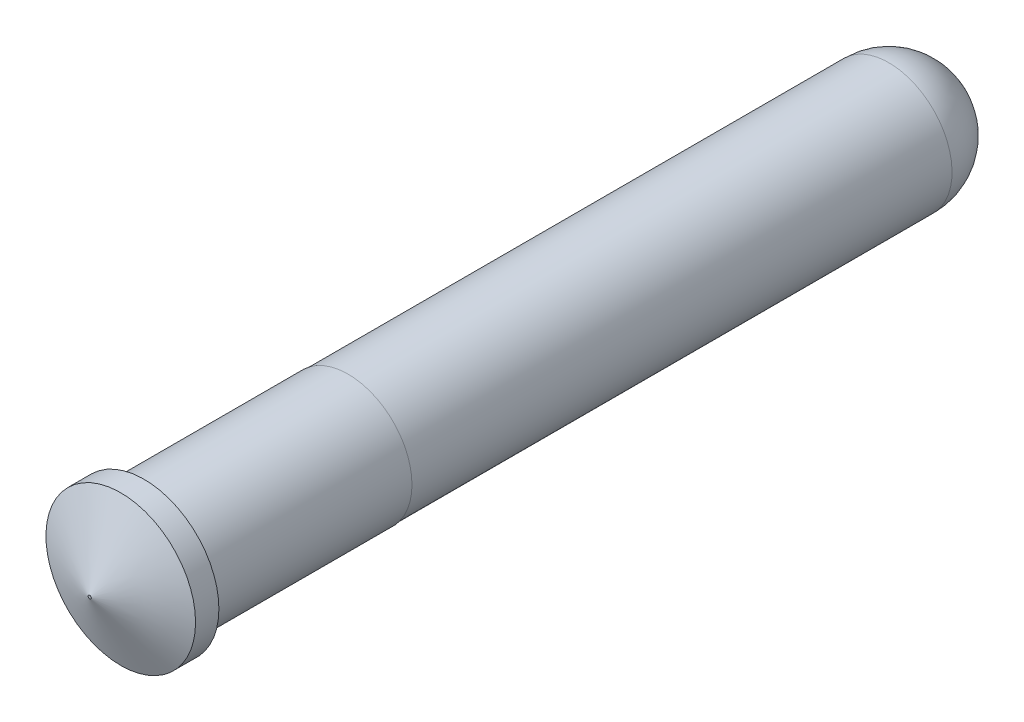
ISO-10303-21;
HEADER;
FILE_DESCRIPTION(('STEP AP214'),'2;1');
FILE_NAME('part.step','',(''),(''),'','','');
FILE_SCHEMA(('AUTOMOTIVE_DESIGN { 1 0 10303 214 1 1 1 1 }'));
ENDSEC;
DATA;
#1=APPLICATION_CONTEXT('core data for automotive mechanical design processes');
#2=APPLICATION_PROTOCOL_DEFINITION('international standard','automotive_design',2000,#1);
#3=PRODUCT_CONTEXT('',#1,'mechanical');
#4=PRODUCT('Part','Part','',(#3));
#5=PRODUCT_RELATED_PRODUCT_CATEGORY('part','',(#4));
#6=PRODUCT_DEFINITION_FORMATION('','',#4);
#7=PRODUCT_DEFINITION_CONTEXT('part definition',#1,'design');
#8=PRODUCT_DEFINITION('design','',#6,#7);
#9=PRODUCT_DEFINITION_SHAPE('','',#8);
#10=(LENGTH_UNIT() NAMED_UNIT(*) SI_UNIT(.MILLI.,.METRE.));
#11=(NAMED_UNIT(*) PLANE_ANGLE_UNIT() SI_UNIT($,.RADIAN.));
#12=(NAMED_UNIT(*) SI_UNIT($,.STERADIAN.) SOLID_ANGLE_UNIT());
#13=UNCERTAINTY_MEASURE_WITH_UNIT(LENGTH_MEASURE(1.E-05),#10,'distance_accuracy_value','');
#14=(GEOMETRIC_REPRESENTATION_CONTEXT(3) GLOBAL_UNCERTAINTY_ASSIGNED_CONTEXT((#13)) GLOBAL_UNIT_ASSIGNED_CONTEXT((#10,
#11,#12)) REPRESENTATION_CONTEXT('',''));
#15=CARTESIAN_POINT('',(0.,0.,0.));
#16=DIRECTION('',(0.,0.,1.));
#17=DIRECTION('',(1.,0.,0.));
#18=AXIS2_PLACEMENT_3D('',#15,#16,#17);
#19=CARTESIAN_POINT('',(0.,0.,0.871417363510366));
#20=DIRECTION('',(0.,0.,-1.));
#21=DIRECTION('',(0.,1.,0.));
#22=AXIS2_PLACEMENT_3D('',#19,#20,#21);
#23=CYLINDRICAL_SURFACE('',#22,2.794);
#24=CARTESIAN_POINT('',(0.,0.,0.871417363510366));
#25=DIRECTION('',(0.,0.,1.));
#26=DIRECTION('',(1.,0.,0.));
#27=AXIS2_PLACEMENT_3D('',#24,#25,#26);
#28=CIRCLE('',#27,2.794);
#29=CARTESIAN_POINT('',(0.,-2.79400000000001,0.871417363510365));
#30=VERTEX_POINT('',#29);
#31=EDGE_CURVE('E19',#30,#30,#28,.T.);
#32=ORIENTED_EDGE('',*,*,#31,.F.);
#33=EDGE_LOOP('',(#32));
#34=FACE_BOUND('',#33,.T.);
#35=CARTESIAN_POINT('',(0.,0.,0.));
#36=DIRECTION('',(0.,0.,1.));
#37=DIRECTION('',(1.,0.,0.));
#38=AXIS2_PLACEMENT_3D('',#35,#36,#37);
#39=CIRCLE('',#38,2.794);
#40=CARTESIAN_POINT('',(2.794,0.,0.));
#41=VERTEX_POINT('',#40);
#42=EDGE_CURVE('E23',#41,#41,#39,.T.);
#43=ORIENTED_EDGE('',*,*,#42,.T.);
#44=EDGE_LOOP('',(#43));
#45=FACE_BOUND('',#44,.T.);
#46=ADVANCED_FACE('F13',(#34,#45),#23,.T.);
#47=CARTESIAN_POINT('',(0.,0.,0.));
#48=DIRECTION('',(0.,0.,1.));
#49=DIRECTION('',(0.,-1.,0.));
#50=AXIS2_PLACEMENT_3D('',#47,#48,#49);
#51=PLANE('',#50);
#52=CARTESIAN_POINT('',(0.,0.,0.));
#53=DIRECTION('',(0.,0.,1.));
#54=DIRECTION('',(1.,0.,0.));
#55=AXIS2_PLACEMENT_3D('',#52,#53,#54);
#56=CIRCLE('',#55,2.38506);
#57=CARTESIAN_POINT('',(2.38506,0.,0.));
#58=VERTEX_POINT('',#57);
#59=EDGE_CURVE('E38',#58,#58,#56,.T.);
#60=ORIENTED_EDGE('',*,*,#59,.T.);
#61=EDGE_LOOP('',(#60));
#62=FACE_BOUND('',#61,.T.);
#63=ORIENTED_EDGE('',*,*,#42,.F.);
#64=EDGE_LOOP('',(#63));
#65=FACE_BOUND('',#64,.T.);
#66=ADVANCED_FACE('F46',(#62,#65),#51,.F.);
#67=CARTESIAN_POINT('',(0.,0.,0.87141736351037));
#68=DIRECTION('',(0.,0.,-1.));
#69=DIRECTION('',(0.,-1.,0.));
#70=AXIS2_PLACEMENT_3D('',#67,#68,#69);
#71=CONICAL_SURFACE('',#70,2.794,1.1693705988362);
#72=CARTESIAN_POINT('',(0.,0.,2.032));
#73=DIRECTION('',(0.,0.,1.));
#74=DIRECTION('',(0.,-1.,0.));
#75=AXIS2_PLACEMENT_3D('',#72,#73,#74);
#76=CIRCLE('',#75,0.0598386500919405);
#77=CARTESIAN_POINT('',(0.,-0.0598386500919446,2.032));
#78=VERTEX_POINT('',#77);
#79=EDGE_CURVE('E28',#78,#78,#76,.T.);
#80=CARTESIAN_POINT('',(0.,-0.0598386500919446,2.032));
#81=CARTESIAN_POINT('',(0.,-0.0883194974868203,2.01991059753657));
#82=CARTESIAN_POINT('',(0.,-0.116800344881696,2.00782119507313));
#83=CARTESIAN_POINT('',(0.,-0.173762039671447,1.98364239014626));
#84=CARTESIAN_POINT('',(0.,-0.202242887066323,1.97155298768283));
#85=CARTESIAN_POINT('',(0.,-0.259204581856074,1.94737418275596));
#86=CARTESIAN_POINT('',(0.,-0.28768542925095,1.93528478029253));
#87=CARTESIAN_POINT('',(0.,-0.344647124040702,1.91110597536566));
#88=CARTESIAN_POINT('',(0.,-0.373127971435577,1.89901657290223));
#89=CARTESIAN_POINT('',(0.,-0.430089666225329,1.87483776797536));
#90=CARTESIAN_POINT('',(0.,-0.458570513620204,1.86274836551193));
#91=CARTESIAN_POINT('',(0.,-0.515532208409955,1.83856956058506));
#92=CARTESIAN_POINT('',(0.,-0.544013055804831,1.82648015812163));
#93=CARTESIAN_POINT('',(0.,-0.600974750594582,1.80230135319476));
#94=CARTESIAN_POINT('',(0.,-0.629455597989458,1.79021195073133));
#95=CARTESIAN_POINT('',(0.,-0.68641729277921,1.76603314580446));
#96=CARTESIAN_POINT('',(0.,-0.714898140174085,1.75394374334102));
#97=CARTESIAN_POINT('',(0.,-0.771859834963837,1.72976493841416));
#98=CARTESIAN_POINT('',(0.,-0.800340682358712,1.71767553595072));
#99=CARTESIAN_POINT('',(0.,-0.857302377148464,1.69349673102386));
#100=CARTESIAN_POINT('',(0.,-0.885783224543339,1.68140732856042));
#101=CARTESIAN_POINT('',(0.,-0.942744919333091,1.65722852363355));
#102=CARTESIAN_POINT('',(0.,-0.971225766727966,1.64513912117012));
#103=CARTESIAN_POINT('',(0.,-1.02818746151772,1.62096031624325));
#104=CARTESIAN_POINT('',(0.,-1.05666830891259,1.60887091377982));
#105=CARTESIAN_POINT('',(0.,-1.11363000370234,1.58469210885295));
#106=CARTESIAN_POINT('',(0.,-1.14211085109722,1.57260270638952));
#107=CARTESIAN_POINT('',(0.,-1.19907254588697,1.54842390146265));
#108=CARTESIAN_POINT('',(0.,-1.22755339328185,1.53633449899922));
#109=CARTESIAN_POINT('',(0.,-1.2845150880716,1.51215569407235));
#110=CARTESIAN_POINT('',(0.,-1.31299593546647,1.50006629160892));
#111=CARTESIAN_POINT('',(0.,-1.36995763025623,1.47588748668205));
#112=CARTESIAN_POINT('',(0.,-1.3984384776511,1.46379808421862));
#113=CARTESIAN_POINT('',(0.,-1.45540017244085,1.43961927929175));
#114=CARTESIAN_POINT('',(0.,-1.48388101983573,1.42752987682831));
#115=CARTESIAN_POINT('',(0.,-1.54084271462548,1.40335107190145));
#116=CARTESIAN_POINT('',(0.,-1.56932356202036,1.39126166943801));
#117=CARTESIAN_POINT('',(0.,-1.62628525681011,1.36708286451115));
#118=CARTESIAN_POINT('',(0.,-1.65476610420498,1.35499346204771));
#119=CARTESIAN_POINT('',(0.,-1.71172779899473,1.33081465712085));
#120=CARTESIAN_POINT('',(0.,-1.74020864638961,1.31872525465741));
#121=CARTESIAN_POINT('',(0.,-1.79717034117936,1.29454644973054));
#122=CARTESIAN_POINT('',(0.,-1.82565118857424,1.28245704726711));
#123=CARTESIAN_POINT('',(0.,-1.88261288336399,1.25827824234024));
#124=CARTESIAN_POINT('',(0.,-1.91109373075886,1.24618883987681));
#125=CARTESIAN_POINT('',(0.,-1.96805542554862,1.22201003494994));
#126=CARTESIAN_POINT('',(0.,-1.99653627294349,1.20992063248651));
#127=CARTESIAN_POINT('',(0.,-2.05349796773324,1.18574182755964));
#128=CARTESIAN_POINT('',(0.,-2.08197881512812,1.17365242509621));
#129=CARTESIAN_POINT('',(0.,-2.13894050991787,1.14947362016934));
#130=CARTESIAN_POINT('',(0.,-2.16742135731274,1.13738421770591));
#131=CARTESIAN_POINT('',(0.,-2.2243830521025,1.11320541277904));
#132=CARTESIAN_POINT('',(0.,-2.25286389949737,1.10111601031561));
#133=CARTESIAN_POINT('',(0.,-2.30982559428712,1.07693720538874));
#134=CARTESIAN_POINT('',(0.,-2.338306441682,1.0648478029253));
#135=CARTESIAN_POINT('',(0.,-2.39526813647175,1.04066899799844));
#136=CARTESIAN_POINT('',(0.,-2.42374898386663,1.028579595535));
#137=CARTESIAN_POINT('',(0.,-2.48071067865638,1.00440079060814));
#138=CARTESIAN_POINT('',(0.,-2.50919152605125,0.992311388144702));
#139=CARTESIAN_POINT('',(0.,-2.566153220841,0.968132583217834));
#140=CARTESIAN_POINT('',(0.,-2.59463406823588,0.9560431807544));
#141=CARTESIAN_POINT('',(0.,-2.65159576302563,0.931864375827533));
#142=CARTESIAN_POINT('',(0.,-2.68007661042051,0.919774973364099));
#143=CARTESIAN_POINT('',(0.,-2.73703830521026,0.895596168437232));
#144=CARTESIAN_POINT('',(0.,-2.76551915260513,0.883506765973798));
#145=CARTESIAN_POINT('',(0.,-2.79400000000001,0.871417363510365));
#146=B_SPLINE_CURVE_WITH_KNOTS('',3,(#80,#81,#82,#83,#84,#85,#86,#87,#88,#89,#90,#91,#92,#93,
#94,#95,#96,#97,#98,#99,#100,#101,#102,#103,#104,#105,#106,#107,#108,#109,#110,#111,#112,#113,
#114,#115,#116,#117,#118,#119,#120,#121,#122,#123,#124,#125,#126,#127,#128,#129,#130,#131,#132,
#133,#134,#135,#136,#137,#138,#139,#140,#141,#142,#143,#144,#145),.UNSPECIFIED.,.F.,.F.,(4,2,2,
2,2,2,2,2,2,2,2,2,2,2,2,2,2,2,2,2,2,2,2,2,2,2,2,2,2,2,2,2,4),(0.,0.0928213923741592,
0.185642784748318,0.278464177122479,0.371285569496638,0.464106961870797,0.556928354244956,
0.649749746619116,0.742571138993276,0.835392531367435,0.928213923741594,1.02103531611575,
1.11385670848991,1.20667810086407,1.29949949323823,1.39232088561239,1.48514227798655,
1.57796367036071,1.67078506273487,1.76360645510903,1.85642784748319,1.94924923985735,
2.04207063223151,2.13489202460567,2.22771341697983,2.32053480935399,2.41335620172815,
2.5061775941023,2.59899898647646,2.69182037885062,2.78464177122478,2.87746316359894,
2.9702845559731),.UNSPECIFIED.);
#147=EDGE_CURVE('BSEAM62',#78,#30,#146,.T.);
#148=ORIENTED_EDGE('',*,*,#79,.F.);
#149=ORIENTED_EDGE('',*,*,#31,.T.);
#150=ORIENTED_EDGE('',*,*,#147,.T.);
#151=ORIENTED_EDGE('',*,*,#147,.F.);
#152=EDGE_LOOP('',(#148,#150,#149,#151));
#153=FACE_BOUND('',#152,.T.);
#154=ADVANCED_FACE('F62',(#153),#71,.T.);
#155=CARTESIAN_POINT('',(0.,0.,2.032));
#156=DIRECTION('',(0.,0.,1.));
#157=DIRECTION('',(0.,-1.,0.));
#158=AXIS2_PLACEMENT_3D('',#155,#156,#157);
#159=PLANE('',#158);
#160=ORIENTED_EDGE('',*,*,#79,.T.);
#161=EDGE_LOOP('',(#160));
#162=FACE_BOUND('',#161,.T.);
#163=ADVANCED_FACE('F52',(#162),#159,.T.);
#164=CARTESIAN_POINT('',(0.,0.,-7.62));
#165=DIRECTION('',(0.,0.,1.));
#166=DIRECTION('',(0.,-1.,0.));
#167=AXIS2_PLACEMENT_3D('',#164,#165,#166);
#168=CYLINDRICAL_SURFACE('',#167,2.38506);
#169=CARTESIAN_POINT('',(0.,0.,-7.62));
#170=DIRECTION('',(0.,0.,1.));
#171=DIRECTION('',(1.,0.,0.));
#172=AXIS2_PLACEMENT_3D('',#169,#170,#171);
#173=CIRCLE('',#172,2.38506);
#174=CARTESIAN_POINT('',(2.38506,0.,-7.62));
#175=VERTEX_POINT('',#174);
#176=EDGE_CURVE('E33',#175,#175,#173,.T.);
#177=ORIENTED_EDGE('',*,*,#176,.T.);
#178=EDGE_LOOP('',(#177));
#179=FACE_BOUND('',#178,.T.);
#180=ORIENTED_EDGE('',*,*,#59,.F.);
#181=EDGE_LOOP('',(#180));
#182=FACE_BOUND('',#181,.T.);
#183=ADVANCED_FACE('F49',(#179,#182),#168,.T.);
#184=CARTESIAN_POINT('',(0.,0.,-7.62));
#185=DIRECTION('',(0.,0.,1.));
#186=DIRECTION('',(0.,-1.,0.));
#187=AXIS2_PLACEMENT_3D('',#184,#185,#186);
#188=PLANE('',#187);
#189=CARTESIAN_POINT('',(0.,0.,-7.62));
#190=DIRECTION('',(0.,0.,1.));
#191=DIRECTION('',(0.,-1.,0.));
#192=AXIS2_PLACEMENT_3D('',#189,#190,#191);
#193=CIRCLE('',#192,2.3622);
#194=CARTESIAN_POINT('',(0.,-2.3622,-7.62));
#195=VERTEX_POINT('',#194);
#196=EDGE_CURVE('E31',#195,#195,#193,.F.);
#197=ORIENTED_EDGE('',*,*,#196,.F.);
#198=EDGE_LOOP('',(#197));
#199=FACE_BOUND('',#198,.T.);
#200=ORIENTED_EDGE('',*,*,#176,.F.);
#201=EDGE_LOOP('',(#200));
#202=FACE_BOUND('',#201,.T.);
#203=ADVANCED_FACE('F51',(#199,#202),#188,.F.);
#204=CARTESIAN_POINT('',(0.,0.,-30.1752));
#205=DIRECTION('',(0.,0.,1.));
#206=DIRECTION('',(0.,-1.,0.));
#207=AXIS2_PLACEMENT_3D('',#204,#205,#206);
#208=CYLINDRICAL_SURFACE('',#207,2.3622);
#209=CARTESIAN_POINT('',(0.,0.,-27.813));
#210=DIRECTION('',(0.,0.,1.));
#211=DIRECTION('',(0.,-1.,0.));
#212=AXIS2_PLACEMENT_3D('',#209,#210,#211);
#213=CIRCLE('',#212,2.3622);
#214=CARTESIAN_POINT('',(0.,-2.36219999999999,-27.813));
#215=VERTEX_POINT('',#214);
#216=EDGE_CURVE('E8',#215,#215,#213,.T.);
#217=ORIENTED_EDGE('',*,*,#216,.T.);
#218=EDGE_LOOP('',(#217));
#219=FACE_BOUND('',#218,.T.);
#220=ORIENTED_EDGE('',*,*,#196,.T.);
#221=EDGE_LOOP('',(#220));
#222=FACE_BOUND('',#221,.T.);
#223=ADVANCED_FACE('F59',(#219,#222),#208,.T.);
#224=CARTESIAN_POINT('',(0.,0.,-27.813));
#225=DIRECTION('',(0.,0.390731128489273,0.92050485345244));
#226=DIRECTION('',(1.,0.,0.));
#227=AXIS2_PLACEMENT_3D('',#224,#225,#226);
#228=SPHERICAL_SURFACE('',#227,2.3622);
#229=CARTESIAN_POINT('',(0.,0.,-27.813));
#230=DIRECTION('',(0.,0.,1.));
#231=DIRECTION('',(0.,-1.,0.));
#232=AXIS2_PLACEMENT_3D('',#229,#230,#231);
#233=SPHERICAL_SURFACE('',#232,2.3622);
#234=ORIENTED_EDGE('',*,*,#216,.F.);
#235=EDGE_LOOP('',(#234));
#236=FACE_BOUND('',#235,.T.);
#237=ADVANCED_FACE('F79',(#236),#233,.T.);
#238=CLOSED_SHELL('',(#46,#66,#154,#163,#183,#203,#223,#237));
#239=MANIFOLD_SOLID_BREP('B1',#238);
#240=ADVANCED_BREP_SHAPE_REPRESENTATION('',(#18,#239),#14);
#241=SHAPE_DEFINITION_REPRESENTATION(#9,#240);
ENDSEC;
END-ISO-10303-21;
